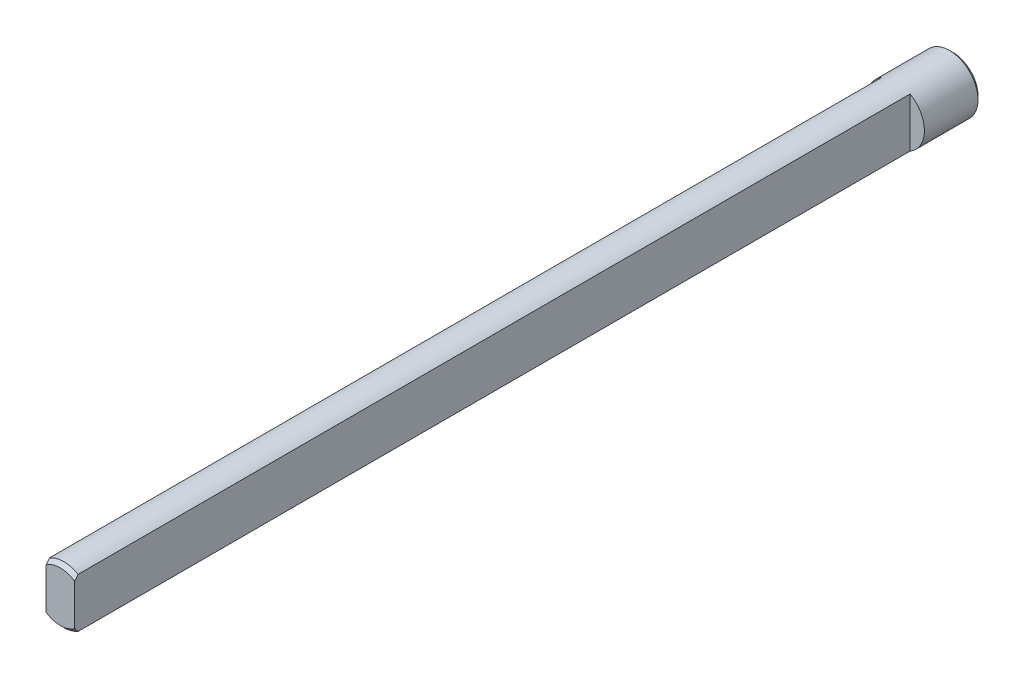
ISO-10303-21;
HEADER;
FILE_DESCRIPTION(('STEP AP214'),'2;1');
FILE_NAME('part.step','',(''),(''),'','','');
FILE_SCHEMA(('AUTOMOTIVE_DESIGN { 1 0 10303 214 1 1 1 1 }'));
ENDSEC;
DATA;
#1=APPLICATION_CONTEXT('core data for automotive mechanical design processes');
#2=APPLICATION_PROTOCOL_DEFINITION('international standard','automotive_design',2000,#1);
#3=PRODUCT_CONTEXT('',#1,'mechanical');
#4=PRODUCT('Part','Part','',(#3));
#5=PRODUCT_RELATED_PRODUCT_CATEGORY('part','',(#4));
#6=PRODUCT_DEFINITION_FORMATION('','',#4);
#7=PRODUCT_DEFINITION_CONTEXT('part definition',#1,'design');
#8=PRODUCT_DEFINITION('design','',#6,#7);
#9=PRODUCT_DEFINITION_SHAPE('','',#8);
#10=(LENGTH_UNIT() NAMED_UNIT(*) SI_UNIT(.MILLI.,.METRE.));
#11=(NAMED_UNIT(*) PLANE_ANGLE_UNIT() SI_UNIT($,.RADIAN.));
#12=(NAMED_UNIT(*) SI_UNIT($,.STERADIAN.) SOLID_ANGLE_UNIT());
#13=UNCERTAINTY_MEASURE_WITH_UNIT(LENGTH_MEASURE(1.E-05),#10,'distance_accuracy_value','');
#14=(GEOMETRIC_REPRESENTATION_CONTEXT(3) GLOBAL_UNCERTAINTY_ASSIGNED_CONTEXT((#13)) GLOBAL_UNIT_ASSIGNED_CONTEXT((#10,
#11,#12)) REPRESENTATION_CONTEXT('',''));
#15=CARTESIAN_POINT('',(0.,0.,0.));
#16=DIRECTION('',(0.,0.,1.));
#17=DIRECTION('',(1.,0.,0.));
#18=AXIS2_PLACEMENT_3D('',#15,#16,#17);
#19=CARTESIAN_POINT('',(0.,0.,125.));
#20=DIRECTION('',(0.,0.,-1.));
#21=DIRECTION('',(-1.,0.,0.));
#22=AXIS2_PLACEMENT_3D('',#19,#20,#21);
#23=CONICAL_SURFACE('',#22,3.49999999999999,0.785398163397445);
#24=CARTESIAN_POINT('',(-2.,-7.6320348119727,120.610262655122));
#25=CARTESIAN_POINT('',(-2.,-7.45879262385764,120.777836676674));
#26=CARTESIAN_POINT('',(-2.,-7.28537603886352,120.945231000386));
#27=CARTESIAN_POINT('',(-2.,-6.93809005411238,121.279553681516));
#28=CARTESIAN_POINT('',(-2.,-6.76422064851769,121.446482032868));
#29=CARTESIAN_POINT('',(-2.,-6.4158396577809,121.779847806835));
#30=CARTESIAN_POINT('',(-2.,-6.24132778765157,121.946284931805));
#31=CARTESIAN_POINT('',(-2.,-5.89160639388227,122.278422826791));
#32=CARTESIAN_POINT('',(-2.,-5.71639687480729,122.444123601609));
#33=CARTESIAN_POINT('',(-2.,-5.3685771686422,122.771282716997));
#34=CARTESIAN_POINT('',(-2.,-5.19598466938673,122.932759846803));
#35=CARTESIAN_POINT('',(-2.,-4.84967507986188,123.254503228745));
#36=CARTESIAN_POINT('',(-2.,-4.67595799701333,123.414769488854));
#37=CARTESIAN_POINT('',(-2.,-4.32705416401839,123.733620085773));
#38=CARTESIAN_POINT('',(-2.,-4.1518677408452,123.892204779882));
#39=CARTESIAN_POINT('',(-2.,-3.79942917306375,124.207058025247));
#40=CARTESIAN_POINT('',(-2.,-3.62217711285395,124.363326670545));
#41=CARTESIAN_POINT('',(-2.,-3.33407539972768,124.612447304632));
#42=CARTESIAN_POINT('',(-2.,-3.22415478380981,124.706372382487));
#43=CARTESIAN_POINT('',(-2.,-3.00288170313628,124.892547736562));
#44=CARTESIAN_POINT('',(-2.,-2.89152909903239,124.984797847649));
#45=CARTESIAN_POINT('',(-2.,-2.66580467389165,125.168016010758));
#46=CARTESIAN_POINT('',(-2.,-2.55141336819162,125.258960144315));
#47=CARTESIAN_POINT('',(-2.,-2.32019554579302,125.437661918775));
#48=CARTESIAN_POINT('',(-2.,-2.20336962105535,125.52542032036));
#49=CARTESIAN_POINT('',(-2.,-1.96462624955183,125.697713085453));
#50=CARTESIAN_POINT('',(-2.,-1.84265836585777,125.782178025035));
#51=CARTESIAN_POINT('',(-2.,-1.59393322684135,125.944287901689));
#52=CARTESIAN_POINT('',(-2.,-1.46716971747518,126.021923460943));
#53=CARTESIAN_POINT('',(-2.,-1.27320853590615,126.12971442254));
#54=CARTESIAN_POINT('',(-2.,-1.20833244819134,126.164014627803));
#55=CARTESIAN_POINT('',(-2.,-1.07690273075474,126.229218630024));
#56=CARTESIAN_POINT('',(-2.,-1.01034879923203,126.260121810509));
#57=CARTESIAN_POINT('',(-2.,-0.808256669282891,126.346282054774));
#58=CARTESIAN_POINT('',(-2.,-0.669801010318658,126.395274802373));
#59=CARTESIAN_POINT('',(-2.,-0.462206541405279,126.448275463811));
#60=CARTESIAN_POINT('',(-2.,-0.395604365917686,126.462328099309));
#61=CARTESIAN_POINT('',(-2.,-0.261347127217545,126.484082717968));
#62=CARTESIAN_POINT('',(-2.,-0.193692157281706,126.491785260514));
#63=CARTESIAN_POINT('',(-2.,-0.0581528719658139,126.500294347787));
#64=CARTESIAN_POINT('',(-2.,0.00973009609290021,126.501122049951));
#65=CARTESIAN_POINT('',(-2.,0.145229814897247,126.495877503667));
#66=CARTESIAN_POINT('',(-2.,0.212846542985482,126.489804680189));
#67=CARTESIAN_POINT('',(-2.,0.346589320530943,126.471263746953));
#68=CARTESIAN_POINT('',(-2.,0.412723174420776,126.458850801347));
#69=CARTESIAN_POINT('',(-2.,0.543669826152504,126.428402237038));
#70=CARTESIAN_POINT('',(-2.,0.608482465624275,126.410365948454));
#71=CARTESIAN_POINT('',(-2.,0.736940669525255,126.369425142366));
#72=CARTESIAN_POINT('',(-2.,0.800577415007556,126.346493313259));
#73=CARTESIAN_POINT('',(-2.,0.926250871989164,126.296680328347));
#74=CARTESIAN_POINT('',(-2.,0.98828790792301,126.269799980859));
#75=CARTESIAN_POINT('',(-2.,1.17293017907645,126.184015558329));
#76=CARTESIAN_POINT('',(-2.,1.29326683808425,126.120242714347));
#77=CARTESIAN_POINT('',(-2.,1.52912321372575,125.984260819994));
#78=CARTESIAN_POINT('',(-2.,1.64463660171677,125.912041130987));
#79=CARTESIAN_POINT('',(-2.,1.87236324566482,125.761676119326));
#80=CARTESIAN_POINT('',(-2.,1.98456168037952,125.683508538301));
#81=CARTESIAN_POINT('',(-2.,2.20604010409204,125.523293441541));
#82=CARTESIAN_POINT('',(-2.,2.31532152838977,125.441247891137));
#83=CARTESIAN_POINT('',(-2.,2.53313460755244,125.273250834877));
#84=CARTESIAN_POINT('',(-2.,2.64163742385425,125.1872621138));
#85=CARTESIAN_POINT('',(-2.,2.8569349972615,125.013157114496));
#86=CARTESIAN_POINT('',(-2.,2.96372956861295,124.925040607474));
#87=CARTESIAN_POINT('',(-2.,3.17571644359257,124.747422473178));
#88=CARTESIAN_POINT('',(-2.,3.28091200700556,124.657924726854));
#89=CARTESIAN_POINT('',(-2.,3.49024017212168,124.477693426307));
#90=CARTESIAN_POINT('',(-2.,3.59437275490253,124.386959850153));
#91=CARTESIAN_POINT('',(-2.,3.87020928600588,124.144338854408));
#92=CARTESIAN_POINT('',(-2.,4.04116480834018,123.991601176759));
#93=CARTESIAN_POINT('',(-2.,4.38139535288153,123.684262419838));
#94=CARTESIAN_POINT('',(-2.,4.55067032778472,123.529661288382));
#95=CARTESIAN_POINT('',(-2.,4.88812679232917,123.218953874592));
#96=CARTESIAN_POINT('',(-2.,5.05630710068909,123.062846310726));
#97=CARTESIAN_POINT('',(-2.,5.39171369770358,122.749609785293));
#98=CARTESIAN_POINT('',(-2.,5.55893998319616,122.592480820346));
#99=CARTESIAN_POINT('',(-2.,5.88578529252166,122.283916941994));
#100=CARTESIAN_POINT('',(-2.,6.04543425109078,122.132513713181));
#101=CARTESIAN_POINT('',(-2.,6.36418592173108,121.829132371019));
#102=CARTESIAN_POINT('',(-2.,6.52328863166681,121.677154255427));
#103=CARTESIAN_POINT('',(-2.,6.84087364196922,121.3729054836));
#104=CARTESIAN_POINT('',(-2.,6.999356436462,121.220635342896));
#105=CARTESIAN_POINT('',(-2.,7.31595322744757,120.915714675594));
#106=CARTESIAN_POINT('',(-2.,7.47406722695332,120.763064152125));
#107=CARTESIAN_POINT('',(-2.,7.6320348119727,120.610262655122));
#108=B_SPLINE_CURVE_WITH_KNOTS('',3,(#24,#25,#26,#27,#28,#29,#30,#31,#32,#33,#34,#35,#36,#37,
#38,#39,#40,#41,#42,#43,#44,#45,#46,#47,#48,#49,#50,#51,#52,#53,#54,#55,#56,#57,#58,#59,#60,#61,
#62,#63,#64,#65,#66,#67,#68,#69,#70,#71,#72,#73,#74,#75,#76,#77,#78,#79,#80,#81,#82,#83,#84,#85,
#86,#87,#88,#89,#90,#91,#92,#93,#94,#95,#96,#97,#98,#99,#100,#101,#102,#103,#104,#105,#106,
#107),.UNSPECIFIED.,.F.,.F.,(4,2,2,2,2,2,2,2,2,2,2,2,2,2,2,2,2,2,2,2,2,2,2,2,2,2,2,2,2,2,2,2,2,
2,2,2,2,2,2,2,2,4),(0.,0.723080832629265,1.44617103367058,2.16963421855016,2.89309267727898,
3.60214938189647,4.31120141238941,5.02009963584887,5.72896899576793,6.16270802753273,
6.5964895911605,7.03486433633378,7.47313370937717,7.9180753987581,8.36361882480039,
8.58367918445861,8.8037794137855,9.24229445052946,9.44625024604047,9.65018807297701,
9.85349804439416,10.056824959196,10.2584121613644,10.4600233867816,10.6627902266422,
10.8655156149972,11.2734886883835,11.6819812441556,12.0920857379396,12.5019845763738,
12.9172828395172,13.3326259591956,13.7469609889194,14.1613033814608,14.8490250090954,
15.5367659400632,16.2251552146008,16.9135467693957,17.5736181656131,18.2336921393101,
18.8930297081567,19.5523618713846),.UNSPECIFIED.);
#109=CARTESIAN_POINT('',(-2.,-3.46410161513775,124.5));
#110=VERTEX_POINT('',#109);
#111=CARTESIAN_POINT('',(-2.,-2.872281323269,125.));
#112=VERTEX_POINT('',#111);
#113=EDGE_CURVE('E11',#110,#112,#108,.T.);
#114=ORIENTED_EDGE('',*,*,#113,.F.);
#115=CARTESIAN_POINT('',(0.,0.,124.5));
#116=DIRECTION('',(0.,0.,1.));
#117=DIRECTION('',(1.,0.,0.));
#118=AXIS2_PLACEMENT_3D('',#115,#116,#117);
#119=CIRCLE('',#118,4.);
#120=CARTESIAN_POINT('',(2.,-3.46410161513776,124.5));
#121=VERTEX_POINT('',#120);
#122=EDGE_CURVE('E132',#121,#110,#119,.F.);
#123=ORIENTED_EDGE('',*,*,#122,.F.);
#124=CARTESIAN_POINT('',(2.,7.6320348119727,120.610262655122));
#125=CARTESIAN_POINT('',(2.,7.45879262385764,120.777836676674));
#126=CARTESIAN_POINT('',(2.,7.28537603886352,120.945231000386));
#127=CARTESIAN_POINT('',(2.,6.93809005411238,121.279553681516));
#128=CARTESIAN_POINT('',(2.,6.76422064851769,121.446482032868));
#129=CARTESIAN_POINT('',(2.,6.4158396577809,121.779847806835));
#130=CARTESIAN_POINT('',(2.,6.24132778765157,121.946284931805));
#131=CARTESIAN_POINT('',(2.,5.89160639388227,122.278422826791));
#132=CARTESIAN_POINT('',(2.,5.71639687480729,122.444123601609));
#133=CARTESIAN_POINT('',(2.,5.3685771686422,122.771282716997));
#134=CARTESIAN_POINT('',(2.,5.19598466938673,122.932759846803));
#135=CARTESIAN_POINT('',(2.,4.84967507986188,123.254503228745));
#136=CARTESIAN_POINT('',(2.,4.67595799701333,123.414769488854));
#137=CARTESIAN_POINT('',(2.,4.32705416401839,123.733620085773));
#138=CARTESIAN_POINT('',(2.,4.1518677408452,123.892204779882));
#139=CARTESIAN_POINT('',(2.,3.79942917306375,124.207058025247));
#140=CARTESIAN_POINT('',(2.,3.62217711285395,124.363326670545));
#141=CARTESIAN_POINT('',(2.,3.33407539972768,124.612447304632));
#142=CARTESIAN_POINT('',(2.,3.22415478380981,124.706372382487));
#143=CARTESIAN_POINT('',(2.,3.00288170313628,124.892547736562));
#144=CARTESIAN_POINT('',(2.,2.89152909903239,124.984797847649));
#145=CARTESIAN_POINT('',(2.,2.66580467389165,125.168016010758));
#146=CARTESIAN_POINT('',(2.,2.55141336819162,125.258960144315));
#147=CARTESIAN_POINT('',(2.,2.32019554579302,125.437661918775));
#148=CARTESIAN_POINT('',(2.,2.20336962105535,125.52542032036));
#149=CARTESIAN_POINT('',(2.,1.96462624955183,125.697713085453));
#150=CARTESIAN_POINT('',(2.,1.84265836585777,125.782178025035));
#151=CARTESIAN_POINT('',(2.,1.59393322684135,125.944287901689));
#152=CARTESIAN_POINT('',(2.,1.46716971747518,126.021923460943));
#153=CARTESIAN_POINT('',(2.,1.27320853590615,126.12971442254));
#154=CARTESIAN_POINT('',(2.,1.20833244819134,126.164014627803));
#155=CARTESIAN_POINT('',(2.,1.07690273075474,126.229218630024));
#156=CARTESIAN_POINT('',(2.,1.01034879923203,126.260121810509));
#157=CARTESIAN_POINT('',(2.,0.808256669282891,126.346282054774));
#158=CARTESIAN_POINT('',(2.,0.669801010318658,126.395274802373));
#159=CARTESIAN_POINT('',(2.,0.462206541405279,126.448275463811));
#160=CARTESIAN_POINT('',(2.,0.395604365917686,126.462328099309));
#161=CARTESIAN_POINT('',(2.,0.261347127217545,126.484082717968));
#162=CARTESIAN_POINT('',(2.,0.193692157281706,126.491785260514));
#163=CARTESIAN_POINT('',(2.,0.0581528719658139,126.500294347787));
#164=CARTESIAN_POINT('',(2.,-0.00973009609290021,126.501122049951));
#165=CARTESIAN_POINT('',(2.,-0.145229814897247,126.495877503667));
#166=CARTESIAN_POINT('',(2.,-0.212846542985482,126.489804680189));
#167=CARTESIAN_POINT('',(2.,-0.346589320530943,126.471263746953));
#168=CARTESIAN_POINT('',(2.,-0.412723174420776,126.458850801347));
#169=CARTESIAN_POINT('',(2.,-0.543669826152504,126.428402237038));
#170=CARTESIAN_POINT('',(2.,-0.608482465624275,126.410365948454));
#171=CARTESIAN_POINT('',(2.,-0.736940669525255,126.369425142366));
#172=CARTESIAN_POINT('',(2.,-0.800577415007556,126.346493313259));
#173=CARTESIAN_POINT('',(2.,-0.926250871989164,126.296680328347));
#174=CARTESIAN_POINT('',(2.,-0.98828790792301,126.269799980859));
#175=CARTESIAN_POINT('',(2.,-1.17293017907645,126.184015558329));
#176=CARTESIAN_POINT('',(2.,-1.29326683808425,126.120242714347));
#177=CARTESIAN_POINT('',(2.,-1.52912321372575,125.984260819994));
#178=CARTESIAN_POINT('',(2.,-1.64463660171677,125.912041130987));
#179=CARTESIAN_POINT('',(2.,-1.87236324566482,125.761676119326));
#180=CARTESIAN_POINT('',(2.,-1.98456168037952,125.683508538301));
#181=CARTESIAN_POINT('',(2.,-2.20604010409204,125.523293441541));
#182=CARTESIAN_POINT('',(2.,-2.31532152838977,125.441247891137));
#183=CARTESIAN_POINT('',(2.,-2.53313460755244,125.273250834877));
#184=CARTESIAN_POINT('',(2.,-2.64163742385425,125.1872621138));
#185=CARTESIAN_POINT('',(2.,-2.8569349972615,125.013157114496));
#186=CARTESIAN_POINT('',(2.,-2.96372956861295,124.925040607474));
#187=CARTESIAN_POINT('',(2.,-3.17571644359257,124.747422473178));
#188=CARTESIAN_POINT('',(2.,-3.28091200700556,124.657924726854));
#189=CARTESIAN_POINT('',(2.,-3.49024017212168,124.477693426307));
#190=CARTESIAN_POINT('',(2.,-3.59437275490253,124.386959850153));
#191=CARTESIAN_POINT('',(2.,-3.87020928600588,124.144338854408));
#192=CARTESIAN_POINT('',(2.,-4.04116480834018,123.991601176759));
#193=CARTESIAN_POINT('',(2.,-4.38139535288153,123.684262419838));
#194=CARTESIAN_POINT('',(2.,-4.55067032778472,123.529661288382));
#195=CARTESIAN_POINT('',(2.,-4.88812679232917,123.218953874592));
#196=CARTESIAN_POINT('',(2.,-5.05630710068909,123.062846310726));
#197=CARTESIAN_POINT('',(2.,-5.39171369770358,122.749609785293));
#198=CARTESIAN_POINT('',(2.,-5.55893998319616,122.592480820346));
#199=CARTESIAN_POINT('',(2.,-5.88578529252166,122.283916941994));
#200=CARTESIAN_POINT('',(2.,-6.04543425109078,122.132513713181));
#201=CARTESIAN_POINT('',(2.,-6.36418592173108,121.829132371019));
#202=CARTESIAN_POINT('',(2.,-6.52328863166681,121.677154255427));
#203=CARTESIAN_POINT('',(2.,-6.84087364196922,121.3729054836));
#204=CARTESIAN_POINT('',(2.,-6.999356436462,121.220635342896));
#205=CARTESIAN_POINT('',(2.,-7.31595322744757,120.915714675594));
#206=CARTESIAN_POINT('',(2.,-7.47406722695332,120.763064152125));
#207=CARTESIAN_POINT('',(2.,-7.6320348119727,120.610262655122));
#208=B_SPLINE_CURVE_WITH_KNOTS('',3,(#124,#125,#126,#127,#128,#129,#130,#131,#132,#133,#134,
#135,#136,#137,#138,#139,#140,#141,#142,#143,#144,#145,#146,#147,#148,#149,#150,#151,#152,#153,
#154,#155,#156,#157,#158,#159,#160,#161,#162,#163,#164,#165,#166,#167,#168,#169,#170,#171,#172,
#173,#174,#175,#176,#177,#178,#179,#180,#181,#182,#183,#184,#185,#186,#187,#188,#189,#190,#191,
#192,#193,#194,#195,#196,#197,#198,#199,#200,#201,#202,#203,#204,#205,#206,#207),.UNSPECIFIED.,
.F.,.F.,(4,2,2,2,2,2,2,2,2,2,2,2,2,2,2,2,2,2,2,2,2,2,2,2,2,2,2,2,2,2,2,2,2,2,2,2,2,2,2,2,2,4),
(0.,0.723080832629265,1.44617103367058,2.16963421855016,2.89309267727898,3.60214938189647,
4.31120141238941,5.02009963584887,5.72896899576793,6.16270802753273,6.5964895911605,
7.03486433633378,7.47313370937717,7.9180753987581,8.36361882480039,8.58367918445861,
8.8037794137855,9.24229445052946,9.44625024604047,9.65018807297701,9.85349804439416,
10.056824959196,10.2584121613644,10.4600233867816,10.6627902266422,10.8655156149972,
11.2734886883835,11.6819812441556,12.0920857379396,12.5019845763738,12.9172828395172,
13.3326259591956,13.7469609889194,14.1613033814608,14.8490250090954,15.5367659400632,
16.2251552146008,16.9135467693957,17.5736181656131,18.2336921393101,18.8930297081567,
19.5523618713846),.UNSPECIFIED.);
#209=CARTESIAN_POINT('',(2.,-2.872281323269,125.));
#210=VERTEX_POINT('',#209);
#211=EDGE_CURVE('E143',#210,#121,#208,.T.);
#212=ORIENTED_EDGE('',*,*,#211,.F.);
#213=CARTESIAN_POINT('',(0.,0.,125.));
#214=DIRECTION('',(0.,0.,1.));
#215=DIRECTION('',(1.,0.,0.));
#216=AXIS2_PLACEMENT_3D('',#213,#214,#215);
#217=CIRCLE('',#216,3.49999999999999);
#218=EDGE_CURVE('E58',#112,#210,#217,.T.);
#219=ORIENTED_EDGE('',*,*,#218,.F.);
#220=EDGE_LOOP('',(#114,#123,#212,#219));
#221=FACE_BOUND('',#220,.T.);
#222=ADVANCED_FACE('F32',(#221),#23,.T.);
#223=CARTESIAN_POINT('',(0.,0.,125.));
#224=DIRECTION('',(0.,0.,-1.));
#225=DIRECTION('',(-1.,0.,0.));
#226=AXIS2_PLACEMENT_3D('',#223,#224,#225);
#227=CYLINDRICAL_SURFACE('',#226,4.);
#228=ORIENTED_EDGE('',*,*,#122,.T.);
#229=DIRECTION('',(0.,0.,-1.));
#230=VECTOR('',#229,1.);
#231=CARTESIAN_POINT('',(-2.,-3.46410161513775,130.));
#232=LINE('',#231,#230);
#233=CARTESIAN_POINT('',(-2.,-3.46410161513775,8.));
#234=VERTEX_POINT('',#233);
#235=EDGE_CURVE('E113',#110,#234,#232,.T.);
#236=ORIENTED_EDGE('',*,*,#235,.T.);
#237=CARTESIAN_POINT('',(0.,0.,8.));
#238=DIRECTION('',(0.,0.,-1.));
#239=DIRECTION('',(-1.,0.,0.));
#240=AXIS2_PLACEMENT_3D('',#237,#238,#239);
#241=CIRCLE('',#240,4.);
#242=CARTESIAN_POINT('',(-2.,3.46410161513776,8.));
#243=VERTEX_POINT('',#242);
#244=EDGE_CURVE('E101',#234,#243,#241,.T.);
#245=ORIENTED_EDGE('',*,*,#244,.T.);
#246=DIRECTION('',(0.,0.,-1.));
#247=VECTOR('',#246,1.);
#248=CARTESIAN_POINT('',(-2.,3.46410161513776,130.));
#249=LINE('',#248,#247);
#250=CARTESIAN_POINT('',(-2.,3.46410161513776,124.5));
#251=VERTEX_POINT('',#250);
#252=EDGE_CURVE('E112',#251,#243,#249,.T.);
#253=ORIENTED_EDGE('',*,*,#252,.F.);
#254=CARTESIAN_POINT('',(2.,3.46410161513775,124.5));
#255=VERTEX_POINT('',#254);
#256=EDGE_CURVE('E131',#251,#255,#119,.F.);
#257=ORIENTED_EDGE('',*,*,#256,.T.);
#258=DIRECTION('',(0.,0.,-1.));
#259=VECTOR('',#258,1.);
#260=CARTESIAN_POINT('',(2.,3.46410161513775,130.));
#261=LINE('',#260,#259);
#262=CARTESIAN_POINT('',(2.,3.46410161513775,8.));
#263=VERTEX_POINT('',#262);
#264=EDGE_CURVE('E125',#255,#263,#261,.T.);
#265=ORIENTED_EDGE('',*,*,#264,.T.);
#266=CARTESIAN_POINT('',(0.,0.,8.));
#267=DIRECTION('',(0.,0.,-1.));
#268=DIRECTION('',(-1.,0.,0.));
#269=AXIS2_PLACEMENT_3D('',#266,#267,#268);
#270=CIRCLE('',#269,4.);
#271=CARTESIAN_POINT('',(2.,-3.46410161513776,8.));
#272=VERTEX_POINT('',#271);
#273=EDGE_CURVE('E118',#263,#272,#270,.T.);
#274=ORIENTED_EDGE('',*,*,#273,.T.);
#275=DIRECTION('',(0.,0.,-1.));
#276=VECTOR('',#275,1.);
#277=CARTESIAN_POINT('',(2.,-3.46410161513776,130.));
#278=LINE('',#277,#276);
#279=EDGE_CURVE('E124',#121,#272,#278,.T.);
#280=ORIENTED_EDGE('',*,*,#279,.F.);
#281=EDGE_LOOP('',(#228,#236,#245,#253,#257,#265,#274,#280));
#282=FACE_BOUND('',#281,.T.);
#283=CARTESIAN_POINT('',(0.,0.,0.5));
#284=DIRECTION('',(0.,0.,1.));
#285=DIRECTION('',(1.,0.,0.));
#286=AXIS2_PLACEMENT_3D('',#283,#284,#285);
#287=CIRCLE('',#286,4.);
#288=CARTESIAN_POINT('',(4.,0.,0.5));
#289=VERTEX_POINT('',#288);
#290=EDGE_CURVE('E135',#289,#289,#287,.T.);
#291=ORIENTED_EDGE('',*,*,#290,.T.);
#292=EDGE_LOOP('',(#291));
#293=FACE_BOUND('',#292,.T.);
#294=ADVANCED_FACE('F160',(#282,#293),#227,.T.);
#295=CARTESIAN_POINT('',(0.,0.,125.));
#296=DIRECTION('',(0.,0.,1.));
#297=DIRECTION('',(1.,0.,0.));
#298=AXIS2_PLACEMENT_3D('',#295,#296,#297);
#299=PLANE('',#298);
#300=DIRECTION('',(0.,1.,0.));
#301=VECTOR('',#300,1.);
#302=CARTESIAN_POINT('',(-2.,0.,125.));
#303=LINE('',#302,#301);
#304=CARTESIAN_POINT('',(-2.,2.872281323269,125.));
#305=VERTEX_POINT('',#304);
#306=EDGE_CURVE('E51',#112,#305,#303,.T.);
#307=ORIENTED_EDGE('',*,*,#306,.F.);
#308=ORIENTED_EDGE('',*,*,#218,.T.);
#309=DIRECTION('',(0.,-1.,0.));
#310=VECTOR('',#309,1.);
#311=CARTESIAN_POINT('',(2.,0.,125.));
#312=LINE('',#311,#310);
#313=CARTESIAN_POINT('',(2.,2.872281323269,125.));
#314=VERTEX_POINT('',#313);
#315=EDGE_CURVE('E128',#314,#210,#312,.T.);
#316=ORIENTED_EDGE('',*,*,#315,.F.);
#317=EDGE_CURVE('E141',#314,#305,#217,.T.);
#318=ORIENTED_EDGE('',*,*,#317,.T.);
#319=EDGE_LOOP('',(#307,#308,#316,#318));
#320=FACE_BOUND('',#319,.T.);
#321=ADVANCED_FACE('F156',(#320),#299,.T.);
#322=CARTESIAN_POINT('',(0.,0.,0.));
#323=DIRECTION('',(0.,0.,1.));
#324=DIRECTION('',(1.,0.,0.));
#325=AXIS2_PLACEMENT_3D('',#322,#323,#324);
#326=PLANE('',#325);
#327=CARTESIAN_POINT('',(0.,0.,0.));
#328=DIRECTION('',(0.,0.,-1.));
#329=DIRECTION('',(-1.,0.,0.));
#330=AXIS2_PLACEMENT_3D('',#327,#328,#329);
#331=CIRCLE('',#330,1.64999999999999);
#332=CARTESIAN_POINT('',(-1.64999999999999,0.,0.));
#333=VERTEX_POINT('',#332);
#334=EDGE_CURVE('E102',#333,#333,#331,.T.);
#335=ORIENTED_EDGE('',*,*,#334,.F.);
#336=EDGE_LOOP('',(#335));
#337=FACE_BOUND('',#336,.T.);
#338=CARTESIAN_POINT('',(0.,0.,0.));
#339=DIRECTION('',(0.,0.,1.));
#340=DIRECTION('',(1.,0.,0.));
#341=AXIS2_PLACEMENT_3D('',#338,#339,#340);
#342=CIRCLE('',#341,3.50000000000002);
#343=CARTESIAN_POINT('',(3.50000000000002,0.,0.));
#344=VERTEX_POINT('',#343);
#345=EDGE_CURVE('E138',#344,#344,#342,.F.);
#346=ORIENTED_EDGE('',*,*,#345,.T.);
#347=EDGE_LOOP('',(#346));
#348=FACE_BOUND('',#347,.T.);
#349=ADVANCED_FACE('F159',(#337,#348),#326,.F.);
#350=CARTESIAN_POINT('',(0.,0.,0.5));
#351=DIRECTION('',(0.,0.,1.));
#352=DIRECTION('',(1.,0.,0.));
#353=AXIS2_PLACEMENT_3D('',#350,#351,#352);
#354=CONICAL_SURFACE('',#353,4.,0.785398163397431);
#355=ORIENTED_EDGE('',*,*,#345,.F.);
#356=EDGE_LOOP('',(#355));
#357=FACE_BOUND('',#356,.T.);
#358=ORIENTED_EDGE('',*,*,#290,.F.);
#359=EDGE_LOOP('',(#358));
#360=FACE_BOUND('',#359,.T.);
#361=ADVANCED_FACE('F163',(#357,#360),#354,.T.);
#362=EDGE_CURVE('E37',#305,#251,#108,.T.);
#363=ORIENTED_EDGE('',*,*,#362,.F.);
#364=ORIENTED_EDGE('',*,*,#317,.F.);
#365=EDGE_CURVE('E148',#255,#314,#208,.T.);
#366=ORIENTED_EDGE('',*,*,#365,.F.);
#367=ORIENTED_EDGE('',*,*,#256,.F.);
#368=EDGE_LOOP('',(#363,#364,#366,#367));
#369=FACE_BOUND('',#368,.T.);
#370=ADVANCED_FACE('F34',(#369),#23,.T.);
#371=CARTESIAN_POINT('',(2.,3.46410161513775,130.));
#372=DIRECTION('',(-1.,0.,0.));
#373=DIRECTION('',(0.,-1.,0.));
#374=AXIS2_PLACEMENT_3D('',#371,#372,#373);
#375=PLANE('',#374);
#376=ORIENTED_EDGE('',*,*,#365,.T.);
#377=ORIENTED_EDGE('',*,*,#315,.T.);
#378=ORIENTED_EDGE('',*,*,#211,.T.);
#379=ORIENTED_EDGE('',*,*,#279,.T.);
#380=DIRECTION('',(0.,1.,0.));
#381=VECTOR('',#380,1.);
#382=CARTESIAN_POINT('',(2.,3.46410161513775,8.));
#383=LINE('',#382,#381);
#384=EDGE_CURVE('E121',#272,#263,#383,.T.);
#385=ORIENTED_EDGE('',*,*,#384,.T.);
#386=ORIENTED_EDGE('',*,*,#264,.F.);
#387=EDGE_LOOP('',(#376,#377,#378,#379,#385,#386));
#388=FACE_BOUND('',#387,.T.);
#389=ADVANCED_FACE('F149',(#388),#375,.F.);
#390=CARTESIAN_POINT('',(0.,0.,8.));
#391=DIRECTION('',(0.,0.,-1.));
#392=DIRECTION('',(-1.,0.,0.));
#393=AXIS2_PLACEMENT_3D('',#390,#391,#392);
#394=PLANE('',#393);
#395=ORIENTED_EDGE('',*,*,#273,.F.);
#396=ORIENTED_EDGE('',*,*,#384,.F.);
#397=EDGE_LOOP('',(#395,#396));
#398=FACE_BOUND('',#397,.T.);
#399=ADVANCED_FACE('F154',(#398),#394,.F.);
#400=CARTESIAN_POINT('',(-2.,3.46410161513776,130.));
#401=DIRECTION('',(1.,0.,0.));
#402=DIRECTION('',(0.,1.,0.));
#403=AXIS2_PLACEMENT_3D('',#400,#401,#402);
#404=PLANE('',#403);
#405=ORIENTED_EDGE('',*,*,#113,.T.);
#406=ORIENTED_EDGE('',*,*,#306,.T.);
#407=ORIENTED_EDGE('',*,*,#362,.T.);
#408=ORIENTED_EDGE('',*,*,#252,.T.);
#409=DIRECTION('',(0.,-1.,0.));
#410=VECTOR('',#409,1.);
#411=CARTESIAN_POINT('',(-2.,3.46410161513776,8.));
#412=LINE('',#411,#410);
#413=EDGE_CURVE('E105',#243,#234,#412,.T.);
#414=ORIENTED_EDGE('',*,*,#413,.T.);
#415=ORIENTED_EDGE('',*,*,#235,.F.);
#416=EDGE_LOOP('',(#405,#406,#407,#408,#414,#415));
#417=FACE_BOUND('',#416,.T.);
#418=ADVANCED_FACE('F188',(#417),#404,.F.);
#419=CARTESIAN_POINT('',(0.,0.,8.));
#420=DIRECTION('',(0.,0.,-1.));
#421=DIRECTION('',(-1.,0.,0.));
#422=AXIS2_PLACEMENT_3D('',#419,#420,#421);
#423=PLANE('',#422);
#424=ORIENTED_EDGE('',*,*,#244,.F.);
#425=ORIENTED_EDGE('',*,*,#413,.F.);
#426=EDGE_LOOP('',(#424,#425));
#427=FACE_BOUND('',#426,.T.);
#428=ADVANCED_FACE('F95',(#427),#423,.F.);
#429=CARTESIAN_POINT('',(0.,0.,18.5));
#430=DIRECTION('',(0.,0.,-1.));
#431=DIRECTION('',(-1.,0.,0.));
#432=AXIS2_PLACEMENT_3D('',#429,#430,#431);
#433=CONICAL_SURFACE('',#432,1.65,1.02974425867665);
#434=CARTESIAN_POINT('',(0.,0.,19.4914200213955));
#435=VERTEX_POINT('',#434);
#436=VERTEX_LOOP('',#435);
#437=FACE_BOUND('',#436,.T.);
#438=CARTESIAN_POINT('',(0.,0.,18.5));
#439=DIRECTION('',(0.,0.,-1.));
#440=DIRECTION('',(-1.,0.,0.));
#441=AXIS2_PLACEMENT_3D('',#438,#439,#440);
#442=CIRCLE('',#441,1.65);
#443=CARTESIAN_POINT('',(-1.65,0.,18.5));
#444=VERTEX_POINT('',#443);
#445=EDGE_CURVE('E99',#444,#444,#442,.T.);
#446=ORIENTED_EDGE('',*,*,#445,.T.);
#447=EDGE_LOOP('',(#446));
#448=FACE_BOUND('',#447,.T.);
#449=ADVANCED_FACE('F91',(#437,#448),#433,.F.);
#450=CARTESIAN_POINT('',(0.,0.,0.));
#451=DIRECTION('',(0.,0.,-1.));
#452=DIRECTION('',(-1.,0.,0.));
#453=AXIS2_PLACEMENT_3D('',#450,#451,#452);
#454=CYLINDRICAL_SURFACE('',#453,1.64999999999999);
#455=ORIENTED_EDGE('',*,*,#445,.F.);
#456=EDGE_LOOP('',(#455));
#457=FACE_BOUND('',#456,.T.);
#458=ORIENTED_EDGE('',*,*,#334,.T.);
#459=EDGE_LOOP('',(#458));
#460=FACE_BOUND('',#459,.T.);
#461=ADVANCED_FACE('F94',(#457,#460),#454,.F.);
#462=CLOSED_SHELL('',(#222,#294,#321,#349,#361,#370,#389,#399,#418,#428,#449,#461));
#463=MANIFOLD_SOLID_BREP('B2',#462);
#464=ADVANCED_BREP_SHAPE_REPRESENTATION('',(#18,#463),#14);
#465=SHAPE_DEFINITION_REPRESENTATION(#9,#464);
ENDSEC;
END-ISO-10303-21;
